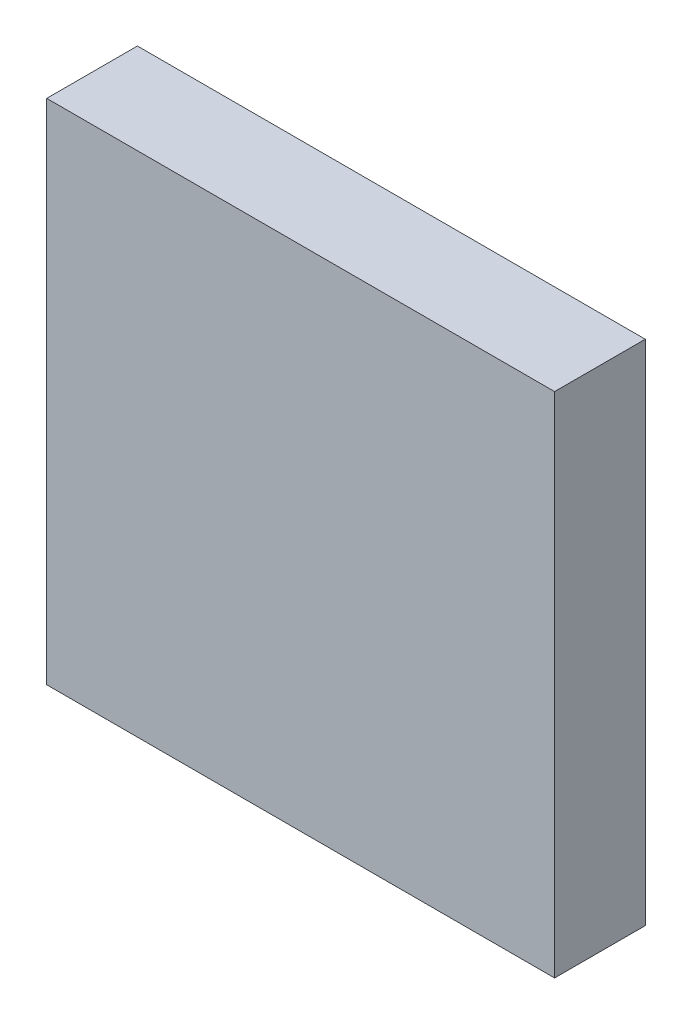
ISO-10303-21;
HEADER;
FILE_DESCRIPTION(('STEP AP214'),'2;1');
FILE_NAME('part.step','',(''),(''),'','','');
FILE_SCHEMA(('AUTOMOTIVE_DESIGN { 1 0 10303 214 1 1 1 1 }'));
ENDSEC;
DATA;
#1=APPLICATION_CONTEXT('core data for automotive mechanical design processes');
#2=APPLICATION_PROTOCOL_DEFINITION('international standard','automotive_design',2000,#1);
#3=PRODUCT_CONTEXT('',#1,'mechanical');
#4=PRODUCT('Part','Part','',(#3));
#5=PRODUCT_RELATED_PRODUCT_CATEGORY('part','',(#4));
#6=PRODUCT_DEFINITION_FORMATION('','',#4);
#7=PRODUCT_DEFINITION_CONTEXT('part definition',#1,'design');
#8=PRODUCT_DEFINITION('design','',#6,#7);
#9=PRODUCT_DEFINITION_SHAPE('','',#8);
#10=(LENGTH_UNIT() NAMED_UNIT(*) SI_UNIT(.MILLI.,.METRE.));
#11=(NAMED_UNIT(*) PLANE_ANGLE_UNIT() SI_UNIT($,.RADIAN.));
#12=(NAMED_UNIT(*) SI_UNIT($,.STERADIAN.) SOLID_ANGLE_UNIT());
#13=UNCERTAINTY_MEASURE_WITH_UNIT(LENGTH_MEASURE(1.E-05),#10,'distance_accuracy_value','');
#14=(GEOMETRIC_REPRESENTATION_CONTEXT(3) GLOBAL_UNCERTAINTY_ASSIGNED_CONTEXT((#13)) GLOBAL_UNIT_ASSIGNED_CONTEXT((#10,
#11,#12)) REPRESENTATION_CONTEXT('',''));
#15=CARTESIAN_POINT('',(0.,0.,0.));
#16=DIRECTION('',(0.,0.,1.));
#17=DIRECTION('',(1.,0.,0.));
#18=AXIS2_PLACEMENT_3D('',#15,#16,#17);
#19=CARTESIAN_POINT('',(-45.4471261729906,36.2224252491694,30.));
#20=DIRECTION('',(1.,0.,0.));
#21=DIRECTION('',(0.,1.,0.));
#22=AXIS2_PLACEMENT_3D('',#19,#20,#21);
#23=PLANE('',#22);
#24=DIRECTION('',(0.,-1.,0.));
#25=VECTOR('',#24,1.);
#26=CARTESIAN_POINT('',(-45.4471261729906,36.2224252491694,0.));
#27=LINE('',#26,#25);
#28=CARTESIAN_POINT('',(-45.4471261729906,36.2224252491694,0.));
#29=VERTEX_POINT('',#28);
#30=CARTESIAN_POINT('',(-45.4471261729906,-131.777574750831,0.));
#31=VERTEX_POINT('',#30);
#32=EDGE_CURVE('E96',#29,#31,#27,.T.);
#33=ORIENTED_EDGE('',*,*,#32,.T.);
#34=DIRECTION('',(0.,0.,-1.));
#35=VECTOR('',#34,1.);
#36=CARTESIAN_POINT('',(-45.4471261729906,-131.777574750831,30.));
#37=LINE('',#36,#35);
#38=CARTESIAN_POINT('',(-45.4471261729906,-131.777574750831,30.));
#39=VERTEX_POINT('',#38);
#40=EDGE_CURVE('E11',#39,#31,#37,.T.);
#41=ORIENTED_EDGE('',*,*,#40,.F.);
#42=DIRECTION('',(0.,-1.,0.));
#43=VECTOR('',#42,1.);
#44=CARTESIAN_POINT('',(-45.4471261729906,36.2224252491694,30.));
#45=LINE('',#44,#43);
#46=CARTESIAN_POINT('',(-45.4471261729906,36.2224252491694,30.));
#47=VERTEX_POINT('',#46);
#48=EDGE_CURVE('E84',#47,#39,#45,.T.);
#49=ORIENTED_EDGE('',*,*,#48,.F.);
#50=DIRECTION('',(0.,0.,-1.));
#51=VECTOR('',#50,1.);
#52=CARTESIAN_POINT('',(-45.4471261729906,36.2224252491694,30.));
#53=LINE('',#52,#51);
#54=EDGE_CURVE('E92',#47,#29,#53,.T.);
#55=ORIENTED_EDGE('',*,*,#54,.T.);
#56=EDGE_LOOP('',(#33,#41,#49,#55));
#57=FACE_BOUND('',#56,.T.);
#58=ADVANCED_FACE('F33',(#57),#23,.F.);
#59=CARTESIAN_POINT('',(-45.4471261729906,-131.777574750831,30.));
#60=DIRECTION('',(0.,1.,0.));
#61=DIRECTION('',(0.,0.,1.));
#62=AXIS2_PLACEMENT_3D('',#59,#60,#61);
#63=PLANE('',#62);
#64=DIRECTION('',(1.,0.,0.));
#65=VECTOR('',#64,1.);
#66=CARTESIAN_POINT('',(-45.4471261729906,-131.777574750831,0.));
#67=LINE('',#66,#65);
#68=CARTESIAN_POINT('',(122.552873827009,-131.777574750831,0.));
#69=VERTEX_POINT('',#68);
#70=EDGE_CURVE('E88',#31,#69,#67,.T.);
#71=ORIENTED_EDGE('',*,*,#70,.T.);
#72=DIRECTION('',(0.,0.,-1.));
#73=VECTOR('',#72,1.);
#74=CARTESIAN_POINT('',(122.552873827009,-131.777574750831,30.));
#75=LINE('',#74,#73);
#76=CARTESIAN_POINT('',(122.552873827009,-131.777574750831,30.));
#77=VERTEX_POINT('',#76);
#78=EDGE_CURVE('E41',#77,#69,#75,.T.);
#79=ORIENTED_EDGE('',*,*,#78,.F.);
#80=DIRECTION('',(1.,0.,0.));
#81=VECTOR('',#80,1.);
#82=CARTESIAN_POINT('',(-45.4471261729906,-131.777574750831,30.));
#83=LINE('',#82,#81);
#84=EDGE_CURVE('E79',#39,#77,#83,.T.);
#85=ORIENTED_EDGE('',*,*,#84,.F.);
#86=ORIENTED_EDGE('',*,*,#40,.T.);
#87=EDGE_LOOP('',(#71,#79,#85,#86));
#88=FACE_BOUND('',#87,.T.);
#89=ADVANCED_FACE('F87',(#88),#63,.F.);
#90=CARTESIAN_POINT('',(122.552873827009,36.2224252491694,30.));
#91=DIRECTION('',(-1.,0.,0.));
#92=DIRECTION('',(0.,-1.,0.));
#93=AXIS2_PLACEMENT_3D('',#90,#91,#92);
#94=PLANE('',#93);
#95=DIRECTION('',(0.,1.,0.));
#96=VECTOR('',#95,1.);
#97=CARTESIAN_POINT('',(122.552873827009,36.2224252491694,0.));
#98=LINE('',#97,#96);
#99=CARTESIAN_POINT('',(122.552873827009,36.2224252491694,0.));
#100=VERTEX_POINT('',#99);
#101=EDGE_CURVE('E66',#69,#100,#98,.T.);
#102=ORIENTED_EDGE('',*,*,#101,.T.);
#103=DIRECTION('',(0.,0.,-1.));
#104=VECTOR('',#103,1.);
#105=CARTESIAN_POINT('',(122.552873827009,36.2224252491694,30.));
#106=LINE('',#105,#104);
#107=CARTESIAN_POINT('',(122.552873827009,36.2224252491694,30.));
#108=VERTEX_POINT('',#107);
#109=EDGE_CURVE('E89',#108,#100,#106,.T.);
#110=ORIENTED_EDGE('',*,*,#109,.F.);
#111=DIRECTION('',(0.,1.,0.));
#112=VECTOR('',#111,1.);
#113=CARTESIAN_POINT('',(122.552873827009,36.2224252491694,30.));
#114=LINE('',#113,#112);
#115=EDGE_CURVE('E82',#77,#108,#114,.T.);
#116=ORIENTED_EDGE('',*,*,#115,.F.);
#117=ORIENTED_EDGE('',*,*,#78,.T.);
#118=EDGE_LOOP('',(#102,#110,#116,#117));
#119=FACE_BOUND('',#118,.T.);
#120=ADVANCED_FACE('F90',(#119),#94,.F.);
#121=CARTESIAN_POINT('',(-45.4471261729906,36.2224252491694,30.));
#122=DIRECTION('',(0.,-1.,0.));
#123=DIRECTION('',(0.,0.,-1.));
#124=AXIS2_PLACEMENT_3D('',#121,#122,#123);
#125=PLANE('',#124);
#126=DIRECTION('',(-1.,0.,0.));
#127=VECTOR('',#126,1.);
#128=CARTESIAN_POINT('',(-45.4471261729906,36.2224252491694,0.));
#129=LINE('',#128,#127);
#130=EDGE_CURVE('E72',#100,#29,#129,.T.);
#131=ORIENTED_EDGE('',*,*,#130,.T.);
#132=ORIENTED_EDGE('',*,*,#54,.F.);
#133=DIRECTION('',(-1.,0.,0.));
#134=VECTOR('',#133,1.);
#135=CARTESIAN_POINT('',(-45.4471261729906,36.2224252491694,30.));
#136=LINE('',#135,#134);
#137=EDGE_CURVE('E49',#108,#47,#136,.T.);
#138=ORIENTED_EDGE('',*,*,#137,.F.);
#139=ORIENTED_EDGE('',*,*,#109,.T.);
#140=EDGE_LOOP('',(#131,#132,#138,#139));
#141=FACE_BOUND('',#140,.T.);
#142=ADVANCED_FACE('F103',(#141),#125,.F.);
#143=CARTESIAN_POINT('',(0.,0.,30.));
#144=DIRECTION('',(0.,0.,1.));
#145=DIRECTION('',(1.,0.,0.));
#146=AXIS2_PLACEMENT_3D('',#143,#144,#145);
#147=PLANE('',#146);
#148=ORIENTED_EDGE('',*,*,#48,.T.);
#149=ORIENTED_EDGE('',*,*,#84,.T.);
#150=ORIENTED_EDGE('',*,*,#115,.T.);
#151=ORIENTED_EDGE('',*,*,#137,.T.);
#152=EDGE_LOOP('',(#148,#149,#150,#151));
#153=FACE_BOUND('',#152,.T.);
#154=ADVANCED_FACE('F80',(#153),#147,.T.);
#155=CARTESIAN_POINT('',(0.,0.,0.));
#156=DIRECTION('',(0.,0.,1.));
#157=DIRECTION('',(1.,0.,0.));
#158=AXIS2_PLACEMENT_3D('',#155,#156,#157);
#159=PLANE('',#158);
#160=ORIENTED_EDGE('',*,*,#32,.F.);
#161=ORIENTED_EDGE('',*,*,#130,.F.);
#162=ORIENTED_EDGE('',*,*,#101,.F.);
#163=ORIENTED_EDGE('',*,*,#70,.F.);
#164=EDGE_LOOP('',(#160,#161,#162,#163));
#165=FACE_BOUND('',#164,.T.);
#166=ADVANCED_FACE('F106',(#165),#159,.F.);
#167=CLOSED_SHELL('',(#58,#89,#120,#142,#154,#166));
#168=MANIFOLD_SOLID_BREP('B2',#167);
#169=ADVANCED_BREP_SHAPE_REPRESENTATION('',(#18,#168),#14);
#170=SHAPE_DEFINITION_REPRESENTATION(#9,#169);
ENDSEC;
END-ISO-10303-21;
